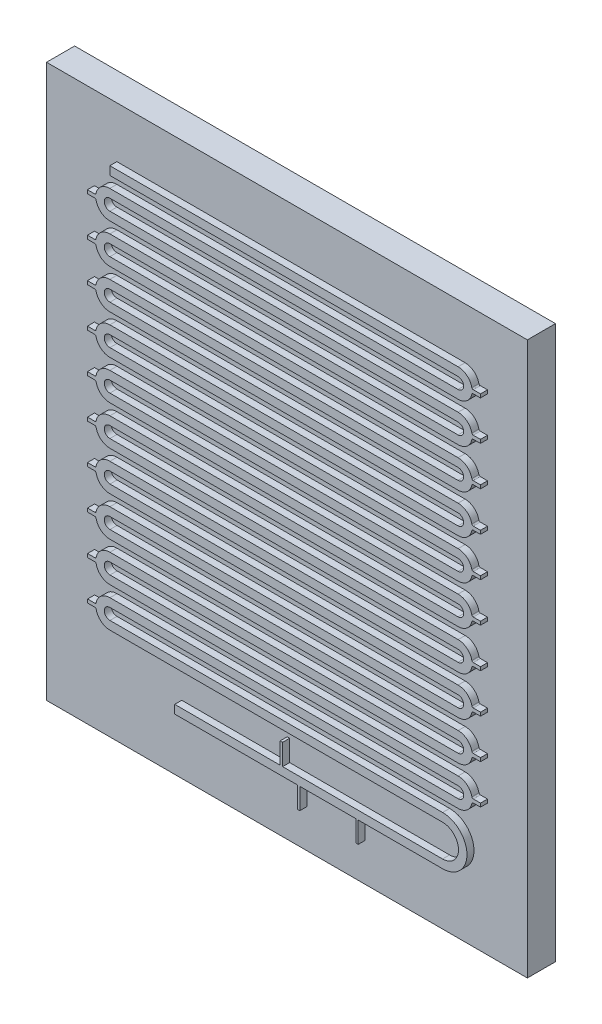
from build123d import *

# Parameters (mm, degrees)
EXTRUDE_1_DEPTH = 1
EXTRUDE_2_DEPTH = 4


with BuildPart() as part:
    # Sketch 1 → Extrude 1 (new body)
    with BuildSketch(Plane.XY):
        with BuildLine():
            Line((-23.537389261, -2.695451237), (25.982217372, -2.695451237))
            ThreePointArc((25.982217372, -2.695451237), (26.782217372, -3.495451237), (25.982217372, -4.295451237))
            Line((25.982217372, -4.295451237), (-23.537389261, -4.295451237))
            ThreePointArc((-23.537389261, -4.295451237), (-24.798701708, -4.743326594), (-25.495103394, -5.886360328))
            ThreePointArc((-25.495103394, -5.886360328), (-25.564743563, -6.000663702), (-25.690874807, -6.045451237))
            Line((-25.690874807, -6.045451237), (-26.721702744, -6.045451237))
            Line((-26.721702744, -6.045451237), (-26.721702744, -6.545451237))
            Line((-26.721702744, -6.545451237), (-25.690874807, -6.545451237))
            ThreePointArc((-25.690874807, -6.545451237), (-25.564743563, -6.590238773), (-25.495103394, -6.704542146))
            ThreePointArc((-25.495103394, -6.704542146), (-24.798701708, -7.847575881), (-23.537389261, -8.295451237))
            Line((-23.537389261, -8.295451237), (23.772652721, -8.295451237))
            ThreePointArc((23.772652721, -8.295451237), (26.037544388, -10.560342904), (23.772652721, -12.825234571))
            Line((23.772652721, -12.825234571), (1.022652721, -12.825234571))
            Line((1.022652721, -12.825234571), (1.022652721, -9.825234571))
            Line((1.022652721, -9.825234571), (0.672652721, -9.825234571))
            Line((0.672652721, -9.825234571), (0.672652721, -12.825234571))
            Line((0.672652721, -12.825234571), (-14.327347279, -12.825234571))
            Line((-14.327347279, -12.825234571), (-14.327347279, -14.025234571))
            Line((-14.327347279, -14.025234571), (3.172652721, -14.025234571))
            Line((3.172652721, -14.025234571), (3.172652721, -17.025234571))
            Line((3.172652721, -17.025234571), (3.472652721, -17.025234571))
            Line((3.472652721, -17.025234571), (3.472652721, -14.025234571))
            Line((3.472652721, -14.025234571), (11.472652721, -14.025234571))
            Line((11.472652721, -14.025234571), (11.472652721, -17.025234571))
            Line((11.472652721, -17.025234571), (11.772652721, -17.025234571))
            Line((11.772652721, -17.025234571), (11.772652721, -14.025234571))
            Line((11.772652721, -14.025234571), (23.772652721, -14.025234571))
            ThreePointArc((23.772652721, -14.025234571), (27.237544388, -10.560342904), (23.772652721, -7.095451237))
            Line((23.772652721, -7.095451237), (-23.537389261, -7.095451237))
            ThreePointArc((-23.537389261, -7.095451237), (-24.337389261, -6.295451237), (-23.537389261, -5.495451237))
            Line((-23.537389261, -5.495451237), (25.982217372, -5.495451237))
            ThreePointArc((25.982217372, -5.495451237), (27.24352982, -5.047575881), (27.939931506, -3.904542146))
            ThreePointArc((27.939931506, -3.904542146), (28.009571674, -3.790238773), (28.135702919, -3.745451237))
            Line((28.135702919, -3.745451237), (29.166530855, -3.745451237))
            Line((29.166530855, -3.745451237), (29.166530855, -3.245451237))
            Line((29.166530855, -3.245451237), (28.135702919, -3.245451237))
            ThreePointArc((28.135702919, -3.245451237), (28.009571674, -3.200663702), (27.939931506, -3.086360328))
            ThreePointArc((27.939931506, -3.086360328), (27.24352982, -1.943326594), (25.982217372, -1.495451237))
            Line((25.982217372, -1.495451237), (-23.537389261, -1.495451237))
            ThreePointArc((-23.537389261, -1.495451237), (-24.337389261, -0.695451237), (-23.537389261, 0.104548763))
            Line((-23.537389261, 0.104548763), (25.982217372, 0.104548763))
            ThreePointArc((25.982217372, 0.104548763), (27.24352982, 0.552424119), (27.939931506, 1.695457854))
            ThreePointArc((27.939931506, 1.695457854), (28.009571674, 1.809761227), (28.135702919, 1.854548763))
            Line((28.135702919, 1.854548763), (29.166530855, 1.854548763))
            Line((29.166530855, 1.854548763), (29.166530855, 2.354548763))
            Line((29.166530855, 2.354548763), (28.135702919, 2.354548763))
            ThreePointArc((28.135702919, 2.354548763), (28.009571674, 2.399336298), (27.939931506, 2.513639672))
            ThreePointArc((27.939931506, 2.513639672), (27.24352982, 3.656673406), (25.982217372, 4.104548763))
            Line((25.982217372, 4.104548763), (-23.537389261, 4.104548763))
            ThreePointArc((-23.537389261, 4.104548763), (-24.337389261, 4.904548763), (-23.537389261, 5.704548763))
            Line((-23.537389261, 5.704548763), (25.982217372, 5.704548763))
            ThreePointArc((25.982217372, 5.704548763), (27.24352982, 6.152424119), (27.939931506, 7.295457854))
            ThreePointArc((27.939931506, 7.295457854), (28.009571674, 7.409761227), (28.135702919, 7.454548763))
            Line((28.135702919, 7.454548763), (29.166530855, 7.454548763))
            Line((29.166530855, 7.454548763), (29.166530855, 7.954548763))
            Line((29.166530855, 7.954548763), (28.135702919, 7.954548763))
            ThreePointArc((28.135702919, 7.954548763), (28.009571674, 7.999336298), (27.939931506, 8.113639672))
            ThreePointArc((27.939931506, 8.113639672), (27.24352982, 9.256673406), (25.982217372, 9.704548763))
            Line((25.982217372, 9.704548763), (-23.537389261, 9.704548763))
            ThreePointArc((-23.537389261, 9.704548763), (-24.337389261, 10.504548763), (-23.537389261, 11.304548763))
            Line((-23.537389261, 11.304548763), (25.982217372, 11.304548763))
            ThreePointArc((25.982217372, 11.304548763), (27.24352982, 11.752424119), (27.939931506, 12.895457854))
            ThreePointArc((27.939931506, 12.895457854), (28.009571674, 13.009761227), (28.135702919, 13.054548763))
            Line((28.135702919, 13.054548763), (29.166530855, 13.054548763))
            Line((29.166530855, 13.054548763), (29.166530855, 13.554548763))
            Line((29.166530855, 13.554548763), (28.135702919, 13.554548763))
            ThreePointArc((28.135702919, 13.554548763), (28.009571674, 13.599336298), (27.939931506, 13.713639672))
            ThreePointArc((27.939931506, 13.713639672), (27.24352982, 14.856673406), (25.982217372, 15.304548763))
            Line((25.982217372, 15.304548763), (-23.546365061, 15.304498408))
            ThreePointArc((-23.546365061, 15.304498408), (-24.346365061, 16.104498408), (-23.546365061, 16.904498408))
            Line((-23.546365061, 16.904498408), (25.973241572, 16.904498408))
            ThreePointArc((25.973241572, 16.904498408), (27.23455402, 17.352373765), (27.930955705, 18.495407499))
            ThreePointArc((27.930955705, 18.495407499), (28.000595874, 18.609710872), (28.126727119, 18.654498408))
            Line((28.126727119, 18.654498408), (29.157555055, 18.654498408))
            Line((29.157555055, 18.654498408), (29.157555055, 19.154498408))
            Line((29.157555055, 19.154498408), (28.126727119, 19.154498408))
            ThreePointArc((28.126727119, 19.154498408), (28.000595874, 19.199285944), (27.930955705, 19.313589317))
            ThreePointArc((27.930955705, 19.313589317), (27.23455402, 20.456623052), (25.973241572, 20.904498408))
            Line((25.973241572, 20.904498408), (-23.546365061, 20.904498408))
            ThreePointArc((-23.546365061, 20.904498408), (-24.346365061, 21.704498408), (-23.546365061, 22.504498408))
            Line((-23.546365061, 22.504498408), (25.973241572, 22.504498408))
            ThreePointArc((25.973241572, 22.504498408), (27.23455402, 22.952373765), (27.930955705, 24.095407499))
            ThreePointArc((27.930955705, 24.095407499), (28.000595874, 24.209710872), (28.126727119, 24.254498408))
            Line((28.126727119, 24.254498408), (29.157555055, 24.254498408))
            Line((29.157555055, 24.254498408), (29.157555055, 24.754498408))
            Line((29.157555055, 24.754498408), (28.126727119, 24.754498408))
            ThreePointArc((28.126727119, 24.754498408), (28.000595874, 24.799285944), (27.930955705, 24.913589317))
            ThreePointArc((27.930955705, 24.913589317), (27.23455402, 26.056623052), (25.973241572, 26.504498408))
            Line((25.973241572, 26.504498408), (-23.546365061, 26.504498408))
            ThreePointArc((-23.546365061, 26.504498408), (-24.346365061, 27.304498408), (-23.546365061, 28.104498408))
            Line((-23.546365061, 28.104498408), (25.973241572, 28.104498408))
            ThreePointArc((25.973241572, 28.104498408), (27.23455402, 28.552373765), (27.930955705, 29.695407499))
            ThreePointArc((27.930955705, 29.695407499), (28.000595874, 29.809710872), (28.126727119, 29.854498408))
            Line((28.126727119, 29.854498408), (29.157555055, 29.854498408))
            Line((29.157555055, 29.854498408), (29.157555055, 30.354498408))
            Line((29.157555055, 30.354498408), (28.126727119, 30.354498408))
            ThreePointArc((28.126727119, 30.354498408), (28.000595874, 30.399285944), (27.930955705, 30.513589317))
            ThreePointArc((27.930955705, 30.513589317), (27.23455402, 31.656623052), (25.973241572, 32.104498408))
            Line((25.973241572, 32.104498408), (-23.546365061, 32.104498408))
            ThreePointArc((-23.546365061, 32.104498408), (-24.346365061, 32.904498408), (-23.546365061, 33.704498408))
            Line((-23.546365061, 33.704498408), (25.973241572, 33.704498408))
            ThreePointArc((25.973241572, 33.704498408), (27.23455402, 34.152373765), (27.930955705, 35.295407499))
            ThreePointArc((27.930955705, 35.295407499), (28.000595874, 35.409710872), (28.126727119, 35.454498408))
            Line((28.126727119, 35.454498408), (29.157555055, 35.454498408))
            Line((29.157555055, 35.454498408), (29.157555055, 35.954498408))
            Line((29.157555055, 35.954498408), (28.126727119, 35.954498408))
            ThreePointArc((28.126727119, 35.954498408), (28.000595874, 35.999285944), (27.930955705, 36.113589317))
            ThreePointArc((27.930955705, 36.113589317), (27.23455402, 37.256623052), (25.973241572, 37.704498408))
            Line((25.973241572, 37.704498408), (-23.546365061, 37.704498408))
            ThreePointArc((-23.546365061, 37.704498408), (-24.346365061, 38.504498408), (-23.546365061, 39.304498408))
            Line((-23.546365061, 39.304498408), (25.973241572, 39.304498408))
            ThreePointArc((25.973241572, 39.304498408), (27.23455402, 39.752373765), (27.930955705, 40.895407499))
            ThreePointArc((27.930955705, 40.895407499), (28.000595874, 41.009710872), (28.126727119, 41.054498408))
            Line((28.126727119, 41.054498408), (29.157555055, 41.054498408))
            Line((29.157555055, 41.054498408), (29.157555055, 41.554498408))
            Line((29.157555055, 41.554498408), (28.126727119, 41.554498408))
            ThreePointArc((28.126727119, 41.554498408), (28.000595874, 41.599285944), (27.930955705, 41.713589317))
            ThreePointArc((27.930955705, 41.713589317), (27.23455402, 42.856623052), (25.973241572, 43.304498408))
            Line((25.973241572, 43.304498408), (-23.546365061, 43.304498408))
            ThreePointArc((-23.546365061, 43.304498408), (-24.346365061, 44.104498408), (-23.546365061, 44.904498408))
            Line((-23.546365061, 44.904498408), (25.973241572, 44.904498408))
            ThreePointArc((25.973241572, 44.904498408), (27.23455402, 45.352373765), (27.930955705, 46.495407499))
            ThreePointArc((27.930955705, 46.495407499), (28.000595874, 46.609710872), (28.126727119, 46.654498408))
            Line((28.126727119, 46.654498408), (29.157555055, 46.654498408))
            Line((29.157555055, 46.654498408), (29.157555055, 47.154498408))
            Line((29.157555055, 47.154498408), (28.126727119, 47.154498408))
            ThreePointArc((28.126727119, 47.154498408), (28.000595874, 47.199285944), (27.930955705, 47.313589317))
            ThreePointArc((27.930955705, 47.313589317), (27.23455402, 48.456623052), (25.973241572, 48.904498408))
            Line((25.973241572, 48.904498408), (-23.555340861, 48.904498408))
            Line((-23.555340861, 48.904498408), (-23.555340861, 47.704448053))
            Line((-23.555340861, 47.704448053), (25.964265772, 47.704448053))
            ThreePointArc((25.964265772, 47.704448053), (26.764265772, 46.904448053), (25.964265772, 46.104448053))
            Line((25.964265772, 46.104448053), (-23.555340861, 46.104448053))
            ThreePointArc((-23.555340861, 46.104448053), (-24.816653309, 45.656572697), (-25.513054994, 44.513538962))
            ThreePointArc((-25.513054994, 44.513538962), (-25.582695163, 44.399235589), (-25.708826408, 44.354448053))
            Line((-25.708826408, 44.354448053), (-26.739654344, 44.354448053))
            Line((-26.739654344, 44.354448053), (-26.739654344, 43.854448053))
            Line((-26.739654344, 43.854448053), (-25.708826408, 43.854448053))
            ThreePointArc((-25.708826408, 43.854448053), (-25.582695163, 43.809660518), (-25.513054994, 43.695357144))
            ThreePointArc((-25.513054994, 43.695357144), (-24.816653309, 42.55232341), (-23.555340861, 42.104448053))
            Line((-23.555340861, 42.104448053), (25.964265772, 42.104448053))
            ThreePointArc((25.964265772, 42.104448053), (26.764265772, 41.304448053), (25.964265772, 40.504448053))
            Line((25.964265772, 40.504448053), (-23.555340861, 40.504448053))
            ThreePointArc((-23.555340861, 40.504448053), (-24.816653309, 40.056572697), (-25.513054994, 38.913538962))
            ThreePointArc((-25.513054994, 38.913538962), (-25.582695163, 38.799235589), (-25.708826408, 38.754448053))
            Line((-25.708826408, 38.754448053), (-26.739654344, 38.754448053))
            Line((-26.739654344, 38.754448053), (-26.739654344, 38.254448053))
            Line((-26.739654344, 38.254448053), (-25.708826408, 38.254448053))
            ThreePointArc((-25.708826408, 38.254448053), (-25.582695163, 38.209660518), (-25.513054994, 38.095357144))
            ThreePointArc((-25.513054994, 38.095357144), (-24.816653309, 36.95232341), (-23.555340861, 36.504448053))
            Line((-23.555340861, 36.504448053), (25.964265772, 36.504448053))
            ThreePointArc((25.964265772, 36.504448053), (26.764265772, 35.704448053), (25.964265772, 34.904448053))
            Line((25.964265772, 34.904448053), (-23.555340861, 34.904448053))
            ThreePointArc((-23.555340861, 34.904448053), (-24.816653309, 34.456572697), (-25.513054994, 33.313538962))
            ThreePointArc((-25.513054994, 33.313538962), (-25.582695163, 33.199235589), (-25.708826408, 33.154448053))
            Line((-25.708826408, 33.154448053), (-26.739654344, 33.154448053))
            Line((-26.739654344, 33.154448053), (-26.739654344, 32.654448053))
            Line((-26.739654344, 32.654448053), (-25.708826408, 32.654448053))
            ThreePointArc((-25.708826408, 32.654448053), (-25.582695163, 32.609660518), (-25.513054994, 32.495357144))
            ThreePointArc((-25.513054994, 32.495357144), (-24.816653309, 31.35232341), (-23.555340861, 30.904448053))
            Line((-23.555340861, 30.904448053), (25.964265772, 30.904448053))
            ThreePointArc((25.964265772, 30.904448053), (26.764265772, 30.104448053), (25.964265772, 29.304448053))
            Line((25.964265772, 29.304448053), (-23.555340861, 29.304448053))
            ThreePointArc((-23.555340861, 29.304448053), (-24.816653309, 28.856572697), (-25.513054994, 27.713538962))
            ThreePointArc((-25.513054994, 27.713538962), (-25.582695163, 27.599235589), (-25.708826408, 27.554448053))
            Line((-25.708826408, 27.554448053), (-26.739654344, 27.554448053))
            Line((-26.739654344, 27.554448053), (-26.739654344, 27.054448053))
            Line((-26.739654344, 27.054448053), (-25.708826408, 27.054448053))
            ThreePointArc((-25.708826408, 27.054448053), (-25.582695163, 27.009660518), (-25.513054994, 26.895357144))
            ThreePointArc((-25.513054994, 26.895357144), (-24.816653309, 25.75232341), (-23.555340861, 25.304448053))
            Line((-23.555340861, 25.304448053), (25.964265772, 25.304448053))
            ThreePointArc((25.964265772, 25.304448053), (26.764253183, 24.508936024), (25.973241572, 23.704498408))
            Line((25.973241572, 23.704498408), (-23.546365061, 23.704498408))
            ThreePointArc((-23.546365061, 23.704498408), (-24.807677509, 23.256623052), (-25.504079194, 22.113589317))
            ThreePointArc((-25.504079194, 22.113589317), (-25.573719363, 21.999285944), (-25.699850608, 21.954498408))
            Line((-25.699850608, 21.954498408), (-26.730678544, 21.954498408))
            Line((-26.730678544, 21.954498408), (-26.730678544, 21.454498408))
            Line((-26.730678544, 21.454498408), (-25.699850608, 21.454498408))
            ThreePointArc((-25.699850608, 21.454498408), (-25.573719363, 21.409710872), (-25.504079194, 21.295407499))
            ThreePointArc((-25.504079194, 21.295407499), (-24.807677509, 20.152373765), (-23.546365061, 19.704498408))
            Line((-23.546365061, 19.704498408), (25.973241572, 19.704498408))
            ThreePointArc((25.973241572, 19.704498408), (26.773241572, 18.904498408), (25.973241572, 18.104498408))
            Line((25.973241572, 18.104498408), (-23.546365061, 18.104498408))
            ThreePointArc((-23.546365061, 18.104498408), (-24.807677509, 17.656623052), (-25.504079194, 16.513589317))
            ThreePointArc((-25.504079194, 16.513589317), (-25.573719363, 16.399285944), (-25.699850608, 16.354498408))
            Line((-25.699850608, 16.354498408), (-26.730678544, 16.354498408))
            Line((-26.730678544, 16.354498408), (-26.730678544, 15.854498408))
            Line((-26.730678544, 15.854498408), (-25.699850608, 15.854498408))
            ThreePointArc((-25.699850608, 15.854498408), (-25.573719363, 15.809710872), (-25.504079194, 15.695407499))
            ThreePointArc((-25.504079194, 15.695407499), (-24.807677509, 14.552373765), (-23.546365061, 14.104498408))
            Line((-23.546365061, 14.104498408), (25.973241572, 14.104498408))
            ThreePointArc((25.973241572, 14.104498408), (26.773241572, 13.304498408), (25.973241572, 12.504498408))
            Line((25.973241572, 12.504498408), (-23.546365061, 12.504498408))
            ThreePointArc((-23.546365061, 12.504498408), (-24.807677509, 12.056623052), (-25.504079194, 10.913589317))
            ThreePointArc((-25.504079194, 10.913589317), (-25.573719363, 10.799285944), (-25.699850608, 10.754498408))
            Line((-25.699850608, 10.754498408), (-26.730678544, 10.754498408))
            Line((-26.730678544, 10.754498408), (-26.730678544, 10.254498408))
            Line((-26.730678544, 10.254498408), (-25.699850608, 10.254498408))
            ThreePointArc((-25.699850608, 10.254498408), (-25.573719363, 10.209710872), (-25.504079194, 10.095407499))
            ThreePointArc((-25.504079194, 10.095407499), (-24.807677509, 8.952373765), (-23.546365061, 8.504498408))
            Line((-23.546365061, 8.504498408), (25.973241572, 8.504498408))
            ThreePointArc((25.973241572, 8.504498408), (26.773241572, 7.704498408), (25.973241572, 6.904498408))
            Line((25.973241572, 6.904498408), (-23.546365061, 6.904498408))
            ThreePointArc((-23.546365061, 6.904498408), (-24.807677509, 6.456623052), (-25.504079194, 5.313589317))
            ThreePointArc((-25.504079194, 5.313589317), (-25.573719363, 5.199285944), (-25.699850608, 5.154498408))
            Line((-25.699850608, 5.154498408), (-26.730678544, 5.154498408))
            Line((-26.730678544, 5.154498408), (-26.730678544, 4.654498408))
            Line((-26.730678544, 4.654498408), (-25.699850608, 4.654498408))
            ThreePointArc((-25.699850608, 4.654498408), (-25.573719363, 4.609710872), (-25.504079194, 4.495407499))
            ThreePointArc((-25.504079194, 4.495407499), (-24.807677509, 3.352373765), (-23.546365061, 2.904498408))
            Line((-23.546365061, 2.904498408), (25.973241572, 2.904498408))
            ThreePointArc((25.973241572, 2.904498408), (26.773228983, 2.108986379), (25.982217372, 1.304548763))
            Line((25.982217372, 1.304548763), (-23.537389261, 1.304548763))
            ThreePointArc((-23.537389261, 1.304548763), (-24.798701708, 0.856673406), (-25.495103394, -0.286360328))
            ThreePointArc((-25.495103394, -0.286360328), (-25.564743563, -0.400663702), (-25.690874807, -0.445451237))
            Line((-25.690874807, -0.445451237), (-26.721702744, -0.445451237))
            Line((-26.721702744, -0.445451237), (-26.721702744, -0.945451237))
            Line((-26.721702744, -0.945451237), (-25.690874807, -0.945451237))
            ThreePointArc((-25.690874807, -0.945451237), (-25.564743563, -0.990238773), (-25.495103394, -1.104542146))
            ThreePointArc((-25.495103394, -1.104542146), (-24.798701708, -2.247575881), (-23.537389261, -2.695451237))
        make_face()
    extrude(amount=EXTRUDE_1_DEPTH)


with BuildPart() as body_2:
    # Sketch 1_2 → Extrude 2 (new body)
    with BuildSketch(Plane.XY):
        Polygon((-33.557582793, -22.455141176), (34.828751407, -22.455141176), (34.828751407, 43.191031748), (34.828751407, 56.1455935), (-33.557582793, 56.1455935), (-33.557582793, 43.191031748), align=None)
    extrude(amount=-EXTRUDE_2_DEPTH)


solid = Compound([part.part, body_2.part])
